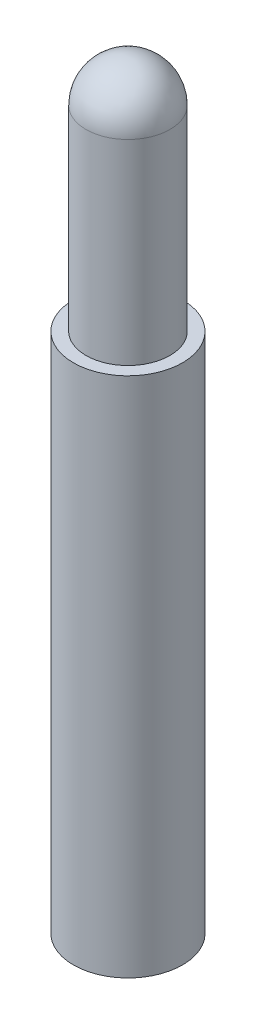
ISO-10303-21;
HEADER;
FILE_DESCRIPTION(('STEP AP214'),'2;1');
FILE_NAME('part.step','',(''),(''),'','','');
FILE_SCHEMA(('AUTOMOTIVE_DESIGN { 1 0 10303 214 1 1 1 1 }'));
ENDSEC;
DATA;
#1=APPLICATION_CONTEXT('core data for automotive mechanical design processes');
#2=APPLICATION_PROTOCOL_DEFINITION('international standard','automotive_design',2000,#1);
#3=PRODUCT_CONTEXT('',#1,'mechanical');
#4=PRODUCT('Part','Part','',(#3));
#5=PRODUCT_RELATED_PRODUCT_CATEGORY('part','',(#4));
#6=PRODUCT_DEFINITION_FORMATION('','',#4);
#7=PRODUCT_DEFINITION_CONTEXT('part definition',#1,'design');
#8=PRODUCT_DEFINITION('design','',#6,#7);
#9=PRODUCT_DEFINITION_SHAPE('','',#8);
#10=(LENGTH_UNIT() NAMED_UNIT(*) SI_UNIT(.MILLI.,.METRE.));
#11=(NAMED_UNIT(*) PLANE_ANGLE_UNIT() SI_UNIT($,.RADIAN.));
#12=(NAMED_UNIT(*) SI_UNIT($,.STERADIAN.) SOLID_ANGLE_UNIT());
#13=UNCERTAINTY_MEASURE_WITH_UNIT(LENGTH_MEASURE(1.E-05),#10,'distance_accuracy_value','');
#14=(GEOMETRIC_REPRESENTATION_CONTEXT(3) GLOBAL_UNCERTAINTY_ASSIGNED_CONTEXT((#13)) GLOBAL_UNIT_ASSIGNED_CONTEXT((#10,
#11,#12)) REPRESENTATION_CONTEXT('',''));
#15=CARTESIAN_POINT('',(0.,0.,0.));
#16=DIRECTION('',(0.,0.,1.));
#17=DIRECTION('',(1.,0.,0.));
#18=AXIS2_PLACEMENT_3D('',#15,#16,#17);
#19=CARTESIAN_POINT('',(0.,29.7499999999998,0.));
#20=DIRECTION('',(0.,1.,0.));
#21=DIRECTION('',(-0.89769110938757,0.,0.440625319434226));
#22=AXIS2_PLACEMENT_3D('',#19,#20,#21);
#23=CYLINDRICAL_SURFACE('',#22,3.);
#24=CARTESIAN_POINT('',(0.,43.7499999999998,0.));
#25=DIRECTION('',(0.,1.,0.));
#26=DIRECTION('',(-0.89769110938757,0.,0.440625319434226));
#27=AXIS2_PLACEMENT_3D('',#24,#25,#26);
#28=CIRCLE('',#27,3.);
#29=CARTESIAN_POINT('',(-2.69307332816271,43.7499999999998,1.32187595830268));
#30=VERTEX_POINT('',#29);
#31=EDGE_CURVE('E9',#30,#30,#28,.F.);
#32=ORIENTED_EDGE('',*,*,#31,.T.);
#33=EDGE_LOOP('',(#32));
#34=FACE_BOUND('',#33,.T.);
#35=CARTESIAN_POINT('',(0.,29.7499999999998,0.));
#36=DIRECTION('',(0.,-1.,0.));
#37=DIRECTION('',(0.89769110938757,0.,-0.440625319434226));
#38=AXIS2_PLACEMENT_3D('',#35,#36,#37);
#39=CIRCLE('',#38,3.);
#40=CARTESIAN_POINT('',(2.69307332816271,29.7499999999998,-1.32187595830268));
#41=VERTEX_POINT('',#40);
#42=EDGE_CURVE('E19',#41,#41,#39,.T.);
#43=ORIENTED_EDGE('',*,*,#42,.F.);
#44=EDGE_LOOP('',(#43));
#45=FACE_BOUND('',#44,.T.);
#46=ADVANCED_FACE('F13',(#34,#45),#23,.T.);
#47=CARTESIAN_POINT('',(0.,43.7499999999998,0.));
#48=DIRECTION('',(0.,-1.,0.));
#49=DIRECTION('',(0.89769110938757,0.,-0.440625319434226));
#50=AXIS2_PLACEMENT_3D('',#47,#48,#49);
#51=SPHERICAL_SURFACE('',#50,3.);
#52=ORIENTED_EDGE('',*,*,#31,.F.);
#53=EDGE_LOOP('',(#52));
#54=FACE_BOUND('',#53,.T.);
#55=ADVANCED_FACE('F37',(#54),#51,.T.);
#56=CARTESIAN_POINT('',(0.,29.7500000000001,0.));
#57=DIRECTION('',(0.,-1.,0.));
#58=DIRECTION('',(0.999589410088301,0.,0.028653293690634));
#59=AXIS2_PLACEMENT_3D('',#56,#57,#58);
#60=PLANE('',#59);
#61=CARTESIAN_POINT('',(0.,29.7500000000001,0.));
#62=DIRECTION('',(0.,-1.,0.));
#63=DIRECTION('',(0.999589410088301,0.,0.028653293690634));
#64=AXIS2_PLACEMENT_3D('',#61,#62,#63);
#65=CIRCLE('',#64,3.9);
#66=CARTESIAN_POINT('',(-3.89839869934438,29.7500000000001,-0.111747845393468));
#67=VERTEX_POINT('',#66);
#68=EDGE_CURVE('E27',#67,#67,#65,.T.);
#69=ORIENTED_EDGE('',*,*,#68,.F.);
#70=EDGE_LOOP('',(#69));
#71=FACE_BOUND('',#70,.T.);
#72=ORIENTED_EDGE('',*,*,#42,.T.);
#73=EDGE_LOOP('',(#72));
#74=FACE_BOUND('',#73,.T.);
#75=ADVANCED_FACE('F35',(#71,#74),#60,.F.);
#76=CARTESIAN_POINT('',(0.,-7.54999999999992,0.));
#77=DIRECTION('',(0.,1.,0.));
#78=DIRECTION('',(-0.999589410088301,0.,-0.028653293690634));
#79=AXIS2_PLACEMENT_3D('',#76,#77,#78);
#80=CYLINDRICAL_SURFACE('',#79,3.9);
#81=CARTESIAN_POINT('',(0.,-7.54999999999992,0.));
#82=DIRECTION('',(0.,-1.,0.));
#83=DIRECTION('',(0.999589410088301,0.,0.028653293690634));
#84=AXIS2_PLACEMENT_3D('',#81,#82,#83);
#85=CIRCLE('',#84,3.9);
#86=CARTESIAN_POINT('',(-3.89839869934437,-7.54999999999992,-0.111747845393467));
#87=VERTEX_POINT('',#86);
#88=EDGE_CURVE('E23',#87,#87,#85,.T.);
#89=CARTESIAN_POINT('',(-3.89839869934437,-7.54999999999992,-0.111747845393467));
#90=CARTESIAN_POINT('',(-3.89839869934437,-7.16145833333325,-0.111747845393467));
#91=CARTESIAN_POINT('',(-3.89839869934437,-6.77291666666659,-0.111747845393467));
#92=CARTESIAN_POINT('',(-3.89839869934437,-5.99583333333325,-0.111747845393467));
#93=CARTESIAN_POINT('',(-3.89839869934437,-5.60729166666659,-0.111747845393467));
#94=CARTESIAN_POINT('',(-3.89839869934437,-4.83020833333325,-0.111747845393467));
#95=CARTESIAN_POINT('',(-3.89839869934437,-4.44166666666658,-0.111747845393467));
#96=CARTESIAN_POINT('',(-3.89839869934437,-3.66458333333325,-0.111747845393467));
#97=CARTESIAN_POINT('',(-3.89839869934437,-3.27604166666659,-0.111747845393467));
#98=CARTESIAN_POINT('',(-3.89839869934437,-2.49895833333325,-0.111747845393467));
#99=CARTESIAN_POINT('',(-3.89839869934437,-2.11041666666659,-0.111747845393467));
#100=CARTESIAN_POINT('',(-3.89839869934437,-1.33333333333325,-0.111747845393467));
#101=CARTESIAN_POINT('',(-3.89839869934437,-0.944791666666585,-0.111747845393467));
#102=CARTESIAN_POINT('',(-3.89839869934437,-0.167708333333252,-0.111747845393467));
#103=CARTESIAN_POINT('',(-3.89839869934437,0.220833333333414,-0.111747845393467));
#104=CARTESIAN_POINT('',(-3.89839869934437,0.997916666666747,-0.111747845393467));
#105=CARTESIAN_POINT('',(-3.89839869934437,1.38645833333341,-0.111747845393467));
#106=CARTESIAN_POINT('',(-3.89839869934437,2.16354166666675,-0.111747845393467));
#107=CARTESIAN_POINT('',(-3.89839869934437,2.55208333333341,-0.111747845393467));
#108=CARTESIAN_POINT('',(-3.89839869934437,3.32916666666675,-0.111747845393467));
#109=CARTESIAN_POINT('',(-3.89839869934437,3.71770833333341,-0.111747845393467));
#110=CARTESIAN_POINT('',(-3.89839869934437,4.49479166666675,-0.111747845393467));
#111=CARTESIAN_POINT('',(-3.89839869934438,4.88333333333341,-0.111747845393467));
#112=CARTESIAN_POINT('',(-3.89839869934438,5.66041666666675,-0.111747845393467));
#113=CARTESIAN_POINT('',(-3.89839869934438,6.04895833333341,-0.111747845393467));
#114=CARTESIAN_POINT('',(-3.89839869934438,6.82604166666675,-0.111747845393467));
#115=CARTESIAN_POINT('',(-3.89839869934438,7.21458333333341,-0.111747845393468));
#116=CARTESIAN_POINT('',(-3.89839869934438,7.99166666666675,-0.111747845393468));
#117=CARTESIAN_POINT('',(-3.89839869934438,8.38020833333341,-0.111747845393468));
#118=CARTESIAN_POINT('',(-3.89839869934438,9.15729166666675,-0.111747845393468));
#119=CARTESIAN_POINT('',(-3.89839869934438,9.54583333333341,-0.111747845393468));
#120=CARTESIAN_POINT('',(-3.89839869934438,10.3229166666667,-0.111747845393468));
#121=CARTESIAN_POINT('',(-3.89839869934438,10.7114583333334,-0.111747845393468));
#122=CARTESIAN_POINT('',(-3.89839869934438,11.4885416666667,-0.111747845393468));
#123=CARTESIAN_POINT('',(-3.89839869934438,11.8770833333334,-0.111747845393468));
#124=CARTESIAN_POINT('',(-3.89839869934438,12.6541666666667,-0.111747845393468));
#125=CARTESIAN_POINT('',(-3.89839869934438,13.0427083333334,-0.111747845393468));
#126=CARTESIAN_POINT('',(-3.89839869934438,13.8197916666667,-0.111747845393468));
#127=CARTESIAN_POINT('',(-3.89839869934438,14.2083333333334,-0.111747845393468));
#128=CARTESIAN_POINT('',(-3.89839869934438,14.9854166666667,-0.111747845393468));
#129=CARTESIAN_POINT('',(-3.89839869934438,15.3739583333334,-0.111747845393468));
#130=CARTESIAN_POINT('',(-3.89839869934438,16.1510416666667,-0.111747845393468));
#131=CARTESIAN_POINT('',(-3.89839869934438,16.5395833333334,-0.111747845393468));
#132=CARTESIAN_POINT('',(-3.89839869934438,17.3166666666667,-0.111747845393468));
#133=CARTESIAN_POINT('',(-3.89839869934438,17.7052083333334,-0.111747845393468));
#134=CARTESIAN_POINT('',(-3.89839869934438,18.4822916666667,-0.111747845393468));
#135=CARTESIAN_POINT('',(-3.89839869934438,18.8708333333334,-0.111747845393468));
#136=CARTESIAN_POINT('',(-3.89839869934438,19.6479166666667,-0.111747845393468));
#137=CARTESIAN_POINT('',(-3.89839869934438,20.0364583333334,-0.111747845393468));
#138=CARTESIAN_POINT('',(-3.89839869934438,20.8135416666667,-0.111747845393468));
#139=CARTESIAN_POINT('',(-3.89839869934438,21.2020833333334,-0.111747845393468));
#140=CARTESIAN_POINT('',(-3.89839869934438,21.9791666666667,-0.111747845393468));
#141=CARTESIAN_POINT('',(-3.89839869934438,22.3677083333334,-0.111747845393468));
#142=CARTESIAN_POINT('',(-3.89839869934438,23.1447916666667,-0.111747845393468));
#143=CARTESIAN_POINT('',(-3.89839869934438,23.5333333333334,-0.111747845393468));
#144=CARTESIAN_POINT('',(-3.89839869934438,24.3104166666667,-0.111747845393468));
#145=CARTESIAN_POINT('',(-3.89839869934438,24.6989583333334,-0.111747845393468));
#146=CARTESIAN_POINT('',(-3.89839869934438,25.4760416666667,-0.111747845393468));
#147=CARTESIAN_POINT('',(-3.89839869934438,25.8645833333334,-0.111747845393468));
#148=CARTESIAN_POINT('',(-3.89839869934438,26.6416666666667,-0.111747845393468));
#149=CARTESIAN_POINT('',(-3.89839869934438,27.0302083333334,-0.111747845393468));
#150=CARTESIAN_POINT('',(-3.89839869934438,27.8072916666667,-0.111747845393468));
#151=CARTESIAN_POINT('',(-3.89839869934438,28.1958333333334,-0.111747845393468));
#152=CARTESIAN_POINT('',(-3.89839869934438,28.9729166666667,-0.111747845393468));
#153=CARTESIAN_POINT('',(-3.89839869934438,29.3614583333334,-0.111747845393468));
#154=CARTESIAN_POINT('',(-3.89839869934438,29.7500000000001,-0.111747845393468));
#155=B_SPLINE_CURVE_WITH_KNOTS('',3,(#89,#90,#91,#92,#93,#94,#95,#96,#97,#98,#99,#100,#101,#102,
#103,#104,#105,#106,#107,#108,#109,#110,#111,#112,#113,#114,#115,#116,#117,#118,#119,#120,#121,
#122,#123,#124,#125,#126,#127,#128,#129,#130,#131,#132,#133,#134,#135,#136,#137,#138,#139,#140,
#141,#142,#143,#144,#145,#146,#147,#148,#149,#150,#151,#152,#153,#154),.UNSPECIFIED.,.F.,.F.,(4,
2,2,2,2,2,2,2,2,2,2,2,2,2,2,2,2,2,2,2,2,2,2,2,2,2,2,2,2,2,2,2,4),(0.,1.165625,2.33125,3.496875,
4.6625,5.828125,6.99375,8.159375,9.325,10.490625,11.65625,12.821875,13.9875,15.153125,16.31875,
17.484375,18.65,19.815625,20.98125,22.146875,23.3125,24.478125,25.64375,26.809375,27.975,
29.140625,30.30625,31.471875,32.6375,33.803125,34.96875,36.134375,37.3),.UNSPECIFIED.);
#156=EDGE_CURVE('BSEAM33',#87,#67,#155,.T.);
#157=ORIENTED_EDGE('',*,*,#88,.F.);
#158=ORIENTED_EDGE('',*,*,#68,.T.);
#159=ORIENTED_EDGE('',*,*,#156,.T.);
#160=ORIENTED_EDGE('',*,*,#156,.F.);
#161=EDGE_LOOP('',(#157,#159,#158,#160));
#162=FACE_BOUND('',#161,.T.);
#163=ADVANCED_FACE('F33',(#162),#80,.T.);
#164=CARTESIAN_POINT('',(0.,-7.54999999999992,0.));
#165=DIRECTION('',(0.,-1.,0.));
#166=DIRECTION('',(0.999589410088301,0.,0.028653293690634));
#167=AXIS2_PLACEMENT_3D('',#164,#165,#166);
#168=PLANE('',#167);
#169=ORIENTED_EDGE('',*,*,#88,.T.);
#170=EDGE_LOOP('',(#169));
#171=FACE_BOUND('',#170,.T.);
#172=ADVANCED_FACE('F45',(#171),#168,.T.);
#173=CLOSED_SHELL('',(#46,#55,#75,#163,#172));
#174=MANIFOLD_SOLID_BREP('B1',#173);
#175=ADVANCED_BREP_SHAPE_REPRESENTATION('',(#18,#174),#14);
#176=SHAPE_DEFINITION_REPRESENTATION(#9,#175);
ENDSEC;
END-ISO-10303-21;
